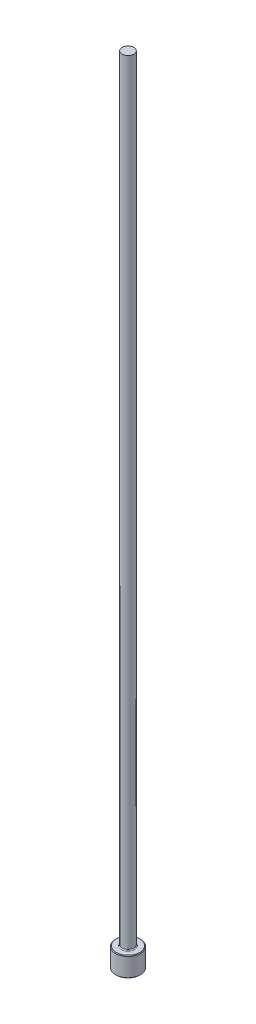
ISO-10303-21;
HEADER;
FILE_DESCRIPTION(('STEP AP214'),'2;1');
FILE_NAME('part.step','',(''),(''),'','','');
FILE_SCHEMA(('AUTOMOTIVE_DESIGN { 1 0 10303 214 1 1 1 1 }'));
ENDSEC;
DATA;
#1=APPLICATION_CONTEXT('core data for automotive mechanical design processes');
#2=APPLICATION_PROTOCOL_DEFINITION('international standard','automotive_design',2000,#1);
#3=PRODUCT_CONTEXT('',#1,'mechanical');
#4=PRODUCT('Part','Part','',(#3));
#5=PRODUCT_RELATED_PRODUCT_CATEGORY('part','',(#4));
#6=PRODUCT_DEFINITION_FORMATION('','',#4);
#7=PRODUCT_DEFINITION_CONTEXT('part definition',#1,'design');
#8=PRODUCT_DEFINITION('design','',#6,#7);
#9=PRODUCT_DEFINITION_SHAPE('','',#8);
#10=(LENGTH_UNIT() NAMED_UNIT(*) SI_UNIT(.MILLI.,.METRE.));
#11=(NAMED_UNIT(*) PLANE_ANGLE_UNIT() SI_UNIT($,.RADIAN.));
#12=(NAMED_UNIT(*) SI_UNIT($,.STERADIAN.) SOLID_ANGLE_UNIT());
#13=UNCERTAINTY_MEASURE_WITH_UNIT(LENGTH_MEASURE(1.E-05),#10,'distance_accuracy_value','');
#14=(GEOMETRIC_REPRESENTATION_CONTEXT(3) GLOBAL_UNCERTAINTY_ASSIGNED_CONTEXT((#13)) GLOBAL_UNIT_ASSIGNED_CONTEXT((#10,
#11,#12)) REPRESENTATION_CONTEXT('',''));
#15=CARTESIAN_POINT('',(0.,0.,0.));
#16=DIRECTION('',(0.,0.,1.));
#17=DIRECTION('',(1.,0.,0.));
#18=AXIS2_PLACEMENT_3D('',#15,#16,#17);
#19=CARTESIAN_POINT('',(0.,0.,0.));
#20=DIRECTION('',(0.,-1.,0.));
#21=DIRECTION('',(0.,0.,-1.));
#22=AXIS2_PLACEMENT_3D('',#19,#20,#21);
#23=PLANE('',#22);
#24=CARTESIAN_POINT('',(0.,0.,0.));
#25=DIRECTION('',(0.,-1.,0.));
#26=DIRECTION('',(0.,0.,-1.));
#27=AXIS2_PLACEMENT_3D('',#24,#25,#26);
#28=CIRCLE('',#27,0.939799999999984);
#29=CARTESIAN_POINT('',(0.,0.,0.939799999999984));
#30=VERTEX_POINT('',#29);
#31=EDGE_CURVE('E46',#30,#30,#28,.T.);
#32=ORIENTED_EDGE('',*,*,#31,.T.);
#33=EDGE_LOOP('',(#32));
#34=FACE_BOUND('',#33,.T.);
#35=ADVANCED_FACE('F35',(#34),#23,.T.);
#36=CARTESIAN_POINT('',(0.,259.958771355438,0.));
#37=DIRECTION('',(0.,1.,0.));
#38=DIRECTION('',(0.,0.,1.));
#39=AXIS2_PLACEMENT_3D('',#36,#37,#38);
#40=CYLINDRICAL_SURFACE('',#39,0.990599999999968);
#41=CARTESIAN_POINT('',(0.,1.52399999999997,0.));
#42=DIRECTION('',(0.,1.,0.));
#43=DIRECTION('',(0.,0.,1.));
#44=AXIS2_PLACEMENT_3D('',#41,#42,#43);
#45=CIRCLE('',#44,0.990599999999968);
#46=CARTESIAN_POINT('',(0.,1.52399999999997,0.990599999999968));
#47=VERTEX_POINT('',#46);
#48=EDGE_CURVE('E50',#47,#47,#45,.F.);
#49=ORIENTED_EDGE('',*,*,#48,.T.);
#50=EDGE_LOOP('',(#49));
#51=FACE_BOUND('',#50,.T.);
#52=CARTESIAN_POINT('',(0.,0.050799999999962,0.));
#53=DIRECTION('',(0.,-1.,0.));
#54=DIRECTION('',(0.,0.,-1.));
#55=AXIS2_PLACEMENT_3D('',#52,#53,#54);
#56=CIRCLE('',#55,0.990599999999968);
#57=CARTESIAN_POINT('',(0.,0.050799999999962,0.990599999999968));
#58=VERTEX_POINT('',#57);
#59=EDGE_CURVE('E55',#58,#58,#56,.F.);
#60=ORIENTED_EDGE('',*,*,#59,.T.);
#61=EDGE_LOOP('',(#60));
#62=FACE_BOUND('',#61,.T.);
#63=ADVANCED_FACE('F77',(#51,#62),#40,.T.);
#64=CARTESIAN_POINT('',(-0.990599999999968,1.5748,0.));
#65=DIRECTION('',(0.,1.,0.));
#66=DIRECTION('',(0.,0.,1.));
#67=AXIS2_PLACEMENT_3D('',#64,#65,#66);
#68=PLANE('',#67);
#69=CARTESIAN_POINT('',(0.,1.5748,0.));
#70=DIRECTION('',(0.,1.,0.));
#71=DIRECTION('',(0.,0.,1.));
#72=AXIS2_PLACEMENT_3D('',#69,#70,#71);
#73=CIRCLE('',#72,0.546099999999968);
#74=CARTESIAN_POINT('',(0.,1.5748,0.546099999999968));
#75=VERTEX_POINT('',#74);
#76=EDGE_CURVE('E10',#75,#75,#73,.F.);
#77=ORIENTED_EDGE('',*,*,#76,.T.);
#78=EDGE_LOOP('',(#77));
#79=FACE_BOUND('',#78,.T.);
#80=CARTESIAN_POINT('',(0.,1.5748,0.));
#81=DIRECTION('',(0.,1.,0.));
#82=DIRECTION('',(0.,0.,1.));
#83=AXIS2_PLACEMENT_3D('',#80,#81,#82);
#84=CIRCLE('',#83,0.939799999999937);
#85=CARTESIAN_POINT('',(0.,1.5748,0.939799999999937));
#86=VERTEX_POINT('',#85);
#87=EDGE_CURVE('E58',#86,#86,#84,.T.);
#88=ORIENTED_EDGE('',*,*,#87,.T.);
#89=EDGE_LOOP('',(#88));
#90=FACE_BOUND('',#89,.T.);
#91=ADVANCED_FACE('F69',(#79,#90),#68,.T.);
#92=CARTESIAN_POINT('',(0.,259.958771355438,0.));
#93=DIRECTION('',(0.,1.,0.));
#94=DIRECTION('',(0.,0.,1.));
#95=AXIS2_PLACEMENT_3D('',#92,#93,#94);
#96=CYLINDRICAL_SURFACE('',#95,0.469899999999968);
#97=CARTESIAN_POINT('',(0.,1.65100000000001,0.));
#98=DIRECTION('',(0.,1.,0.));
#99=DIRECTION('',(0.,0.,1.));
#100=AXIS2_PLACEMENT_3D('',#97,#98,#99);
#101=CIRCLE('',#100,0.469899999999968);
#102=CARTESIAN_POINT('',(0.,1.65100000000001,0.469899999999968));
#103=VERTEX_POINT('',#102);
#104=EDGE_CURVE('E42',#103,#103,#101,.T.);
#105=ORIENTED_EDGE('',*,*,#104,.T.);
#106=EDGE_LOOP('',(#105));
#107=FACE_BOUND('',#106,.T.);
#108=CARTESIAN_POINT('',(0.,63.5,0.));
#109=DIRECTION('',(0.,1.,0.));
#110=DIRECTION('',(0.,0.,1.));
#111=AXIS2_PLACEMENT_3D('',#108,#109,#110);
#112=CIRCLE('',#111,0.469899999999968);
#113=CARTESIAN_POINT('',(0.,63.5,0.469899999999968));
#114=VERTEX_POINT('',#113);
#115=EDGE_CURVE('E61',#114,#114,#112,.T.);
#116=ORIENTED_EDGE('',*,*,#115,.F.);
#117=EDGE_LOOP('',(#116));
#118=FACE_BOUND('',#117,.T.);
#119=ADVANCED_FACE('F67',(#107,#118),#96,.T.);
#120=CARTESIAN_POINT('',(-0.469899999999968,63.5,0.));
#121=DIRECTION('',(0.,1.,0.));
#122=DIRECTION('',(0.,0.,1.));
#123=AXIS2_PLACEMENT_3D('',#120,#121,#122);
#124=PLANE('',#123);
#125=ORIENTED_EDGE('',*,*,#115,.T.);
#126=EDGE_LOOP('',(#125));
#127=FACE_BOUND('',#126,.T.);
#128=ADVANCED_FACE('F65',(#127),#124,.T.);
#129=CARTESIAN_POINT('',(0.,1.57479999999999,0.));
#130=DIRECTION('',(0.,-1.,0.));
#131=DIRECTION('',(0.,0.,-1.));
#132=AXIS2_PLACEMENT_3D('',#129,#130,#131);
#133=CONICAL_SURFACE('',#132,0.939799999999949,0.785398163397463);
#134=ORIENTED_EDGE('',*,*,#48,.F.);
#135=EDGE_LOOP('',(#134));
#136=FACE_BOUND('',#135,.T.);
#137=ORIENTED_EDGE('',*,*,#87,.F.);
#138=EDGE_LOOP('',(#137));
#139=FACE_BOUND('',#138,.T.);
#140=ADVANCED_FACE('F75',(#136,#139),#133,.T.);
#141=CARTESIAN_POINT('',(0.,0.050799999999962,0.));
#142=DIRECTION('',(0.,1.,0.));
#143=DIRECTION('',(0.,0.,1.));
#144=AXIS2_PLACEMENT_3D('',#141,#142,#143);
#145=CONICAL_SURFACE('',#144,0.990599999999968,0.785398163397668);
#146=CARTESIAN_POINT('',(0.,0.,0.939799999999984));
#147=CARTESIAN_POINT('',(0.,0.000529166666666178,0.94032916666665));
#148=CARTESIAN_POINT('',(0.,0.00105833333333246,0.940858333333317));
#149=CARTESIAN_POINT('',(0.,0.00211666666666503,0.94191666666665));
#150=CARTESIAN_POINT('',(0.,0.00264583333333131,0.942445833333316));
#151=CARTESIAN_POINT('',(0.,0.00370416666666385,0.943504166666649));
#152=CARTESIAN_POINT('',(0.,0.0042333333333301,0.944033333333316));
#153=CARTESIAN_POINT('',(0.,0.00529166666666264,0.945091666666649));
#154=CARTESIAN_POINT('',(0.,0.00582083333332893,0.945620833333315));
#155=CARTESIAN_POINT('',(0.,0.00687916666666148,0.946679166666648));
#156=CARTESIAN_POINT('',(0.,0.00740833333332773,0.947208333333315));
#157=CARTESIAN_POINT('',(0.,0.00846666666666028,0.948266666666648));
#158=CARTESIAN_POINT('',(0.,0.00899583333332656,0.948795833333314));
#159=CARTESIAN_POINT('',(0.,0.0100541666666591,0.949854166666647));
#160=CARTESIAN_POINT('',(0.,0.0105833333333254,0.950383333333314));
#161=CARTESIAN_POINT('',(0.,0.0116416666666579,0.951441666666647));
#162=CARTESIAN_POINT('',(0.,0.0121708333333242,0.951970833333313));
#163=CARTESIAN_POINT('',(0.,0.0132291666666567,0.953029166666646));
#164=CARTESIAN_POINT('',(0.,0.013758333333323,0.953558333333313));
#165=CARTESIAN_POINT('',(0.,0.0148166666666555,0.954616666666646));
#166=CARTESIAN_POINT('',(0.,0.0153458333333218,0.955145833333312));
#167=CARTESIAN_POINT('',(0.,0.0164041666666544,0.956204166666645));
#168=CARTESIAN_POINT('',(0.,0.0169333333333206,0.956733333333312));
#169=CARTESIAN_POINT('',(0.,0.0179916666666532,0.957791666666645));
#170=CARTESIAN_POINT('',(0.,0.0185208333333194,0.958320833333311));
#171=CARTESIAN_POINT('',(0.,0.019579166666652,0.959379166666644));
#172=CARTESIAN_POINT('',(0.,0.0201083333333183,0.959908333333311));
#173=CARTESIAN_POINT('',(0.,0.0211666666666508,0.960966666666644));
#174=CARTESIAN_POINT('',(0.,0.0216958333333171,0.96149583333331));
#175=CARTESIAN_POINT('',(0.,0.0227541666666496,0.962554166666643));
#176=CARTESIAN_POINT('',(0.,0.0232833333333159,0.96308333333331));
#177=CARTESIAN_POINT('',(0.,0.0243416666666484,0.964141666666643));
#178=CARTESIAN_POINT('',(0.,0.0248708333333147,0.964670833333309));
#179=CARTESIAN_POINT('',(0.,0.0259291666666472,0.965729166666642));
#180=CARTESIAN_POINT('',(0.,0.0264583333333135,0.966258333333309));
#181=CARTESIAN_POINT('',(0.,0.0275166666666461,0.967316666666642));
#182=CARTESIAN_POINT('',(0.,0.0280458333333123,0.967845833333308));
#183=CARTESIAN_POINT('',(0.,0.0291041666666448,0.968904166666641));
#184=CARTESIAN_POINT('',(0.,0.0296333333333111,0.969433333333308));
#185=CARTESIAN_POINT('',(0.,0.0306916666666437,0.970491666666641));
#186=CARTESIAN_POINT('',(0.,0.03122083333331,0.971020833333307));
#187=CARTESIAN_POINT('',(0.,0.0322791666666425,0.97207916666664));
#188=CARTESIAN_POINT('',(0.,0.0328083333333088,0.972608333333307));
#189=CARTESIAN_POINT('',(0.,0.0338666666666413,0.97366666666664));
#190=CARTESIAN_POINT('',(0.,0.0343958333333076,0.974195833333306));
#191=CARTESIAN_POINT('',(0.,0.0354541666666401,0.975254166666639));
#192=CARTESIAN_POINT('',(0.,0.0359833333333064,0.975783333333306));
#193=CARTESIAN_POINT('',(0.,0.0370416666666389,0.976841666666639));
#194=CARTESIAN_POINT('',(0.,0.0375708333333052,0.977370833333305));
#195=CARTESIAN_POINT('',(0.,0.0386291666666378,0.978429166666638));
#196=CARTESIAN_POINT('',(0.,0.039158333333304,0.978958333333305));
#197=CARTESIAN_POINT('',(0.,0.0402166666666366,0.980016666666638));
#198=CARTESIAN_POINT('',(0.,0.0407458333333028,0.980545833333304));
#199=CARTESIAN_POINT('',(0.,0.0418041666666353,0.981604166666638));
#200=CARTESIAN_POINT('',(0.,0.0423333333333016,0.982133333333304));
#201=CARTESIAN_POINT('',(0.,0.0433916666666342,0.983191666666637));
#202=CARTESIAN_POINT('',(0.,0.0439208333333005,0.983720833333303));
#203=CARTESIAN_POINT('',(0.,0.044979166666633,0.984779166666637));
#204=CARTESIAN_POINT('',(0.,0.0455083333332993,0.985308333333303));
#205=CARTESIAN_POINT('',(0.,0.0465666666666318,0.986366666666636));
#206=CARTESIAN_POINT('',(0.,0.0470958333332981,0.986895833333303));
#207=CARTESIAN_POINT('',(0.,0.0481541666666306,0.987954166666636));
#208=CARTESIAN_POINT('',(0.,0.0486833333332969,0.988483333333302));
#209=CARTESIAN_POINT('',(0.,0.0497416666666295,0.989541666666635));
#210=CARTESIAN_POINT('',(0.,0.0502708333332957,0.990070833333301));
#211=CARTESIAN_POINT('',(0.,0.050799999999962,0.990599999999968));
#212=B_SPLINE_CURVE_WITH_KNOTS('',3,(#146,#147,#148,#149,#150,#151,#152,#153,#154,#155,#156,
#157,#158,#159,#160,#161,#162,#163,#164,#165,#166,#167,#168,#169,#170,#171,#172,#173,#174,#175,
#176,#177,#178,#179,#180,#181,#182,#183,#184,#185,#186,#187,#188,#189,#190,#191,#192,#193,#194,
#195,#196,#197,#198,#199,#200,#201,#202,#203,#204,#205,#206,#207,#208,#209,#210,#211),
.UNSPECIFIED.,.F.,.F.,(4,2,2,2,2,2,2,2,2,2,2,2,2,2,2,2,2,2,2,2,2,2,2,2,2,2,2,2,2,2,2,2,4),(0.,
0.00224506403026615,0.00449012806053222,0.00673519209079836,0.00898025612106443,
0.0112253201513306,0.0134703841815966,0.0157154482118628,0.0179605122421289,0.020205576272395,
0.0224506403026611,0.0246957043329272,0.0269407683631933,0.0291858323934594,0.0314308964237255,
0.0336759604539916,0.0359210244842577,0.0381660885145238,0.0404111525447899,0.042656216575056,
0.0449012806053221,0.0471463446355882,0.0493914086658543,0.0516364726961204,0.0538815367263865,
0.0561266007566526,0.0583716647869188,0.0606167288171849,0.0628617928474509,0.065106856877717,
0.0673519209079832,0.0695969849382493,0.0718420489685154),.UNSPECIFIED.);
#213=EDGE_CURVE('BSEAM89',#30,#58,#212,.T.);
#214=ORIENTED_EDGE('',*,*,#31,.F.);
#215=ORIENTED_EDGE('',*,*,#59,.F.);
#216=ORIENTED_EDGE('',*,*,#213,.T.);
#217=ORIENTED_EDGE('',*,*,#213,.F.);
#218=EDGE_LOOP('',(#214,#216,#215,#217));
#219=FACE_BOUND('',#218,.T.);
#220=ADVANCED_FACE('F89',(#219),#145,.T.);
#221=CARTESIAN_POINT('',(0.,1.65100000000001,0.));
#222=DIRECTION('',(0.,1.,0.));
#223=DIRECTION('',(0.,0.,1.));
#224=AXIS2_PLACEMENT_3D('',#221,#222,#223);
#225=TOROIDAL_SURFACE('',#224,0.546099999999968,0.0762);
#226=ORIENTED_EDGE('',*,*,#76,.F.);
#227=EDGE_LOOP('',(#226));
#228=FACE_BOUND('',#227,.T.);
#229=ORIENTED_EDGE('',*,*,#104,.F.);
#230=EDGE_LOOP('',(#229));
#231=FACE_BOUND('',#230,.T.);
#232=ADVANCED_FACE('F37',(#228,#231),#225,.F.);
#233=CLOSED_SHELL('',(#35,#63,#91,#119,#128,#140,#220,#232));
#234=MANIFOLD_SOLID_BREP('B2',#233);
#235=ADVANCED_BREP_SHAPE_REPRESENTATION('',(#18,#234),#14);
#236=SHAPE_DEFINITION_REPRESENTATION(#9,#235);
ENDSEC;
END-ISO-10303-21;
